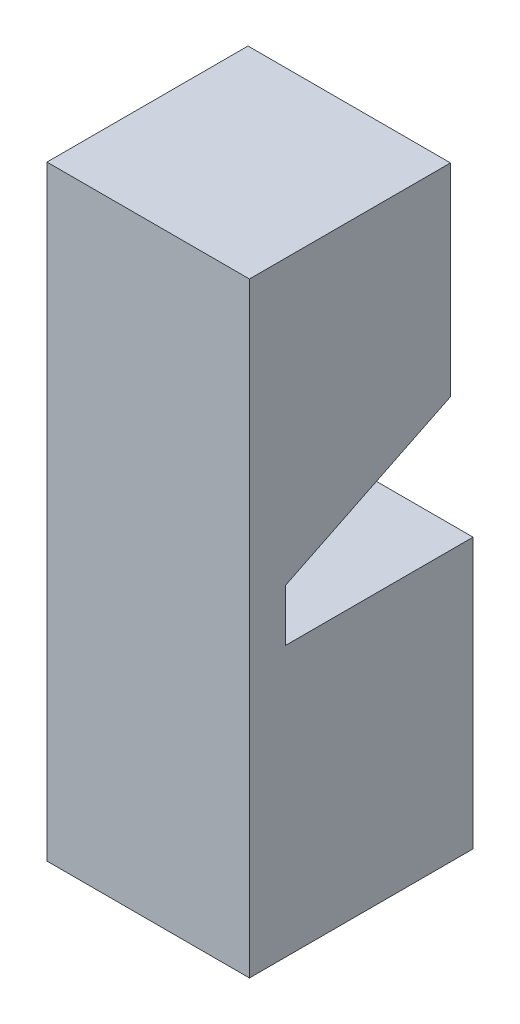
ISO-10303-21;
HEADER;
FILE_DESCRIPTION(('STEP AP214'),'2;1');
FILE_NAME('part.step','',(''),(''),'','','');
FILE_SCHEMA(('AUTOMOTIVE_DESIGN { 1 0 10303 214 1 1 1 1 }'));
ENDSEC;
DATA;
#1=APPLICATION_CONTEXT('core data for automotive mechanical design processes');
#2=APPLICATION_PROTOCOL_DEFINITION('international standard','automotive_design',2000,#1);
#3=PRODUCT_CONTEXT('',#1,'mechanical');
#4=PRODUCT('Part','Part','',(#3));
#5=PRODUCT_RELATED_PRODUCT_CATEGORY('part','',(#4));
#6=PRODUCT_DEFINITION_FORMATION('','',#4);
#7=PRODUCT_DEFINITION_CONTEXT('part definition',#1,'design');
#8=PRODUCT_DEFINITION('design','',#6,#7);
#9=PRODUCT_DEFINITION_SHAPE('','',#8);
#10=(LENGTH_UNIT() NAMED_UNIT(*) SI_UNIT(.MILLI.,.METRE.));
#11=(NAMED_UNIT(*) PLANE_ANGLE_UNIT() SI_UNIT($,.RADIAN.));
#12=(NAMED_UNIT(*) SI_UNIT($,.STERADIAN.) SOLID_ANGLE_UNIT());
#13=UNCERTAINTY_MEASURE_WITH_UNIT(LENGTH_MEASURE(1.E-05),#10,'distance_accuracy_value','');
#14=(GEOMETRIC_REPRESENTATION_CONTEXT(3) GLOBAL_UNCERTAINTY_ASSIGNED_CONTEXT((#13)) GLOBAL_UNIT_ASSIGNED_CONTEXT((#10,
#11,#12)) REPRESENTATION_CONTEXT('',''));
#15=CARTESIAN_POINT('',(0.,0.,0.));
#16=DIRECTION('',(0.,0.,1.));
#17=DIRECTION('',(1.,0.,0.));
#18=AXIS2_PLACEMENT_3D('',#15,#16,#17);
#19=CARTESIAN_POINT('',(609.6,0.,0.));
#20=DIRECTION('',(0.,0.,-1.));
#21=DIRECTION('',(-1.,0.,0.));
#22=AXIS2_PLACEMENT_3D('',#19,#20,#21);
#23=PLANE('',#22);
#24=DIRECTION('',(0.,-1.,0.));
#25=VECTOR('',#24,1.);
#26=CARTESIAN_POINT('',(0.,0.,0.));
#27=LINE('',#26,#25);
#28=CARTESIAN_POINT('',(0.,1822.45,0.));
#29=VERTEX_POINT('',#28);
#30=CARTESIAN_POINT('',(0.,0.,0.));
#31=VERTEX_POINT('',#30);
#32=EDGE_CURVE('E131',#29,#31,#27,.T.);
#33=ORIENTED_EDGE('',*,*,#32,.T.);
#34=DIRECTION('',(-1.,0.,0.));
#35=VECTOR('',#34,1.);
#36=CARTESIAN_POINT('',(609.6,0.,0.));
#37=LINE('',#36,#35);
#38=CARTESIAN_POINT('',(609.6,0.,0.));
#39=VERTEX_POINT('',#38);
#40=EDGE_CURVE('E11',#39,#31,#37,.T.);
#41=ORIENTED_EDGE('',*,*,#40,.F.);
#42=DIRECTION('',(0.,-1.,0.));
#43=VECTOR('',#42,1.);
#44=CARTESIAN_POINT('',(609.6,0.,0.));
#45=LINE('',#44,#43);
#46=CARTESIAN_POINT('',(609.6,1822.45,0.));
#47=VERTEX_POINT('',#46);
#48=EDGE_CURVE('E145',#47,#39,#45,.T.);
#49=ORIENTED_EDGE('',*,*,#48,.F.);
#50=DIRECTION('',(-1.,0.,0.));
#51=VECTOR('',#50,1.);
#52=CARTESIAN_POINT('',(609.6,1822.45,0.));
#53=LINE('',#52,#51);
#54=EDGE_CURVE('E127',#47,#29,#53,.T.);
#55=ORIENTED_EDGE('',*,*,#54,.T.);
#56=EDGE_LOOP('',(#33,#41,#49,#55));
#57=FACE_BOUND('',#56,.T.);
#58=ADVANCED_FACE('F35',(#57),#23,.F.);
#59=CARTESIAN_POINT('',(609.6,0.,0.));
#60=DIRECTION('',(0.,1.,0.));
#61=DIRECTION('',(0.,0.,1.));
#62=AXIS2_PLACEMENT_3D('',#59,#60,#61);
#63=PLANE('',#62);
#64=DIRECTION('',(0.,0.,-1.));
#65=VECTOR('',#64,1.);
#66=CARTESIAN_POINT('',(0.,0.,0.));
#67=LINE('',#66,#65);
#68=CARTESIAN_POINT('',(0.,0.,-673.1));
#69=VERTEX_POINT('',#68);
#70=EDGE_CURVE('E134',#31,#69,#67,.T.);
#71=ORIENTED_EDGE('',*,*,#70,.T.);
#72=DIRECTION('',(-1.,0.,0.));
#73=VECTOR('',#72,1.);
#74=CARTESIAN_POINT('',(609.6,0.,-673.1));
#75=LINE('',#74,#73);
#76=CARTESIAN_POINT('',(609.6,0.,-673.1));
#77=VERTEX_POINT('',#76);
#78=EDGE_CURVE('E43',#77,#69,#75,.T.);
#79=ORIENTED_EDGE('',*,*,#78,.F.);
#80=DIRECTION('',(0.,0.,-1.));
#81=VECTOR('',#80,1.);
#82=CARTESIAN_POINT('',(609.6,0.,0.));
#83=LINE('',#82,#81);
#84=EDGE_CURVE('E94',#39,#77,#83,.T.);
#85=ORIENTED_EDGE('',*,*,#84,.F.);
#86=ORIENTED_EDGE('',*,*,#40,.T.);
#87=EDGE_LOOP('',(#71,#79,#85,#86));
#88=FACE_BOUND('',#87,.T.);
#89=ADVANCED_FACE('F180',(#88),#63,.F.);
#90=CARTESIAN_POINT('',(609.6,0.,-673.1));
#91=DIRECTION('',(0.,0.,1.));
#92=DIRECTION('',(1.,0.,0.));
#93=AXIS2_PLACEMENT_3D('',#90,#91,#92);
#94=PLANE('',#93);
#95=DIRECTION('',(0.,1.,0.));
#96=VECTOR('',#95,1.);
#97=CARTESIAN_POINT('',(0.,0.,-673.1));
#98=LINE('',#97,#96);
#99=CARTESIAN_POINT('',(0.,812.8,-673.1));
#100=VERTEX_POINT('',#99);
#101=EDGE_CURVE('E136',#69,#100,#98,.T.);
#102=ORIENTED_EDGE('',*,*,#101,.T.);
#103=DIRECTION('',(-1.,0.,0.));
#104=VECTOR('',#103,1.);
#105=CARTESIAN_POINT('',(609.6,812.8,-673.1));
#106=LINE('',#105,#104);
#107=CARTESIAN_POINT('',(609.6,812.8,-673.1));
#108=VERTEX_POINT('',#107);
#109=EDGE_CURVE('E152',#108,#100,#106,.T.);
#110=ORIENTED_EDGE('',*,*,#109,.F.);
#111=DIRECTION('',(0.,1.,0.));
#112=VECTOR('',#111,1.);
#113=CARTESIAN_POINT('',(609.6,0.,-673.1));
#114=LINE('',#113,#112);
#115=EDGE_CURVE('E160',#77,#108,#114,.T.);
#116=ORIENTED_EDGE('',*,*,#115,.F.);
#117=ORIENTED_EDGE('',*,*,#78,.T.);
#118=EDGE_LOOP('',(#102,#110,#116,#117));
#119=FACE_BOUND('',#118,.T.);
#120=ADVANCED_FACE('F158',(#119),#94,.F.);
#121=CARTESIAN_POINT('',(609.6,812.8,-108.963945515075));
#122=DIRECTION('',(0.,-1.,0.));
#123=DIRECTION('',(0.,0.,-1.));
#124=AXIS2_PLACEMENT_3D('',#121,#122,#123);
#125=PLANE('',#124);
#126=DIRECTION('',(0.,0.,1.));
#127=VECTOR('',#126,1.);
#128=CARTESIAN_POINT('',(0.,812.8,-108.963945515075));
#129=LINE('',#128,#127);
#130=CARTESIAN_POINT('',(0.,812.8,-108.963945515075));
#131=VERTEX_POINT('',#130);
#132=EDGE_CURVE('E138',#100,#131,#129,.T.);
#133=ORIENTED_EDGE('',*,*,#132,.T.);
#134=DIRECTION('',(-1.,0.,0.));
#135=VECTOR('',#134,1.);
#136=CARTESIAN_POINT('',(609.6,812.8,-108.963945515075));
#137=LINE('',#136,#135);
#138=CARTESIAN_POINT('',(609.6,812.8,-108.963945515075));
#139=VERTEX_POINT('',#138);
#140=EDGE_CURVE('E149',#139,#131,#137,.T.);
#141=ORIENTED_EDGE('',*,*,#140,.F.);
#142=DIRECTION('',(0.,0.,1.));
#143=VECTOR('',#142,1.);
#144=CARTESIAN_POINT('',(609.6,812.8,-108.963945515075));
#145=LINE('',#144,#143);
#146=EDGE_CURVE('E172',#108,#139,#145,.T.);
#147=ORIENTED_EDGE('',*,*,#146,.F.);
#148=ORIENTED_EDGE('',*,*,#109,.T.);
#149=EDGE_LOOP('',(#133,#141,#147,#148));
#150=FACE_BOUND('',#149,.T.);
#151=ADVANCED_FACE('F168',(#150),#125,.F.);
#152=CARTESIAN_POINT('',(609.6,812.8,-108.963945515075));
#153=DIRECTION('',(0.,0.,1.));
#154=DIRECTION('',(0.,-1.,0.));
#155=AXIS2_PLACEMENT_3D('',#152,#153,#154);
#156=PLANE('',#155);
#157=DIRECTION('',(0.,1.,0.));
#158=VECTOR('',#157,1.);
#159=CARTESIAN_POINT('',(0.,812.8,-108.963945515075));
#160=LINE('',#159,#158);
#161=CARTESIAN_POINT('',(0.,969.652240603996,-108.963945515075));
#162=VERTEX_POINT('',#161);
#163=EDGE_CURVE('E140',#131,#162,#160,.T.);
#164=ORIENTED_EDGE('',*,*,#163,.T.);
#165=DIRECTION('',(-1.,0.,0.));
#166=VECTOR('',#165,1.);
#167=CARTESIAN_POINT('',(609.6,969.652240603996,-108.963945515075));
#168=LINE('',#167,#166);
#169=CARTESIAN_POINT('',(609.6,969.652240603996,-108.963945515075));
#170=VERTEX_POINT('',#169);
#171=EDGE_CURVE('E122',#170,#162,#168,.T.);
#172=ORIENTED_EDGE('',*,*,#171,.F.);
#173=DIRECTION('',(0.,1.,0.));
#174=VECTOR('',#173,1.);
#175=CARTESIAN_POINT('',(609.6,812.8,-108.963945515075));
#176=LINE('',#175,#174);
#177=EDGE_CURVE('E113',#139,#170,#176,.T.);
#178=ORIENTED_EDGE('',*,*,#177,.F.);
#179=ORIENTED_EDGE('',*,*,#140,.T.);
#180=EDGE_LOOP('',(#164,#172,#178,#179));
#181=FACE_BOUND('',#180,.T.);
#182=ADVANCED_FACE('F171',(#181),#156,.F.);
#183=CARTESIAN_POINT('',(609.6,969.652240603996,-108.963945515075));
#184=DIRECTION('',(0.,0.897956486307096,0.440084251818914));
#185=DIRECTION('',(0.,-0.440084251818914,0.897956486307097));
#186=AXIS2_PLACEMENT_3D('',#183,#184,#185);
#187=PLANE('',#186);
#188=DIRECTION('',(0.,0.440084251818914,-0.897956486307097));
#189=VECTOR('',#188,1.);
#190=CARTESIAN_POINT('',(0.,969.652240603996,-108.963945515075));
#191=LINE('',#190,#189);
#192=CARTESIAN_POINT('',(0.,1212.85,-605.189394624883));
#193=VERTEX_POINT('',#192);
#194=EDGE_CURVE('E121',#162,#193,#191,.T.);
#195=ORIENTED_EDGE('',*,*,#194,.T.);
#196=DIRECTION('',(-1.,0.,0.));
#197=VECTOR('',#196,1.);
#198=CARTESIAN_POINT('',(609.6,1212.85,-605.189394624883));
#199=LINE('',#198,#197);
#200=CARTESIAN_POINT('',(609.6,1212.85,-605.189394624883));
#201=VERTEX_POINT('',#200);
#202=EDGE_CURVE('E118',#201,#193,#199,.T.);
#203=ORIENTED_EDGE('',*,*,#202,.F.);
#204=DIRECTION('',(0.,0.440084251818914,-0.897956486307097));
#205=VECTOR('',#204,1.);
#206=CARTESIAN_POINT('',(609.6,969.652240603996,-108.963945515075));
#207=LINE('',#206,#205);
#208=EDGE_CURVE('E107',#170,#201,#207,.T.);
#209=ORIENTED_EDGE('',*,*,#208,.F.);
#210=ORIENTED_EDGE('',*,*,#171,.T.);
#211=EDGE_LOOP('',(#195,#203,#209,#210));
#212=FACE_BOUND('',#211,.T.);
#213=ADVANCED_FACE('F119',(#212),#187,.F.);
#214=CARTESIAN_POINT('',(609.6,1212.85,-605.189394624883));
#215=DIRECTION('',(0.,0.,1.));
#216=DIRECTION('',(1.,0.,0.));
#217=AXIS2_PLACEMENT_3D('',#214,#215,#216);
#218=PLANE('',#217);
#219=DIRECTION('',(0.,1.,0.));
#220=VECTOR('',#219,1.);
#221=CARTESIAN_POINT('',(0.,1212.85,-605.189394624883));
#222=LINE('',#221,#220);
#223=CARTESIAN_POINT('',(0.,1822.45,-605.189394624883));
#224=VERTEX_POINT('',#223);
#225=EDGE_CURVE('E80',#193,#224,#222,.T.);
#226=ORIENTED_EDGE('',*,*,#225,.T.);
#227=DIRECTION('',(-1.,0.,0.));
#228=VECTOR('',#227,1.);
#229=CARTESIAN_POINT('',(609.6,1822.45,-605.189394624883));
#230=LINE('',#229,#228);
#231=CARTESIAN_POINT('',(609.6,1822.45,-605.189394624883));
#232=VERTEX_POINT('',#231);
#233=EDGE_CURVE('E123',#232,#224,#230,.T.);
#234=ORIENTED_EDGE('',*,*,#233,.F.);
#235=DIRECTION('',(0.,1.,0.));
#236=VECTOR('',#235,1.);
#237=CARTESIAN_POINT('',(609.6,1212.85,-605.189394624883));
#238=LINE('',#237,#236);
#239=EDGE_CURVE('E111',#201,#232,#238,.T.);
#240=ORIENTED_EDGE('',*,*,#239,.F.);
#241=ORIENTED_EDGE('',*,*,#202,.T.);
#242=EDGE_LOOP('',(#226,#234,#240,#241));
#243=FACE_BOUND('',#242,.T.);
#244=ADVANCED_FACE('F125',(#243),#218,.F.);
#245=CARTESIAN_POINT('',(609.6,1822.45,0.));
#246=DIRECTION('',(0.,-1.,0.));
#247=DIRECTION('',(0.,0.,-1.));
#248=AXIS2_PLACEMENT_3D('',#245,#246,#247);
#249=PLANE('',#248);
#250=DIRECTION('',(0.,0.,1.));
#251=VECTOR('',#250,1.);
#252=CARTESIAN_POINT('',(0.,1822.45,0.));
#253=LINE('',#252,#251);
#254=EDGE_CURVE('E86',#224,#29,#253,.T.);
#255=ORIENTED_EDGE('',*,*,#254,.T.);
#256=ORIENTED_EDGE('',*,*,#54,.F.);
#257=DIRECTION('',(0.,0.,1.));
#258=VECTOR('',#257,1.);
#259=CARTESIAN_POINT('',(609.6,1822.45,0.));
#260=LINE('',#259,#258);
#261=EDGE_CURVE('E51',#232,#47,#260,.T.);
#262=ORIENTED_EDGE('',*,*,#261,.F.);
#263=ORIENTED_EDGE('',*,*,#233,.T.);
#264=EDGE_LOOP('',(#255,#256,#262,#263));
#265=FACE_BOUND('',#264,.T.);
#266=ADVANCED_FACE('F196',(#265),#249,.F.);
#267=CARTESIAN_POINT('',(609.6,1822.45,0.));
#268=DIRECTION('',(-1.,0.,0.));
#269=DIRECTION('',(0.,0.,1.));
#270=AXIS2_PLACEMENT_3D('',#267,#268,#269);
#271=PLANE('',#270);
#272=ORIENTED_EDGE('',*,*,#48,.T.);
#273=ORIENTED_EDGE('',*,*,#84,.T.);
#274=ORIENTED_EDGE('',*,*,#115,.T.);
#275=ORIENTED_EDGE('',*,*,#146,.T.);
#276=ORIENTED_EDGE('',*,*,#177,.T.);
#277=ORIENTED_EDGE('',*,*,#208,.T.);
#278=ORIENTED_EDGE('',*,*,#239,.T.);
#279=ORIENTED_EDGE('',*,*,#261,.T.);
#280=EDGE_LOOP('',(#272,#273,#274,#275,#276,#277,#278,#279));
#281=FACE_BOUND('',#280,.T.);
#282=ADVANCED_FACE('F109',(#281),#271,.F.);
#283=CARTESIAN_POINT('',(0.,1822.45,0.));
#284=DIRECTION('',(-1.,0.,0.));
#285=DIRECTION('',(0.,0.,1.));
#286=AXIS2_PLACEMENT_3D('',#283,#284,#285);
#287=PLANE('',#286);
#288=ORIENTED_EDGE('',*,*,#32,.F.);
#289=ORIENTED_EDGE('',*,*,#254,.F.);
#290=ORIENTED_EDGE('',*,*,#225,.F.);
#291=ORIENTED_EDGE('',*,*,#194,.F.);
#292=ORIENTED_EDGE('',*,*,#163,.F.);
#293=ORIENTED_EDGE('',*,*,#132,.F.);
#294=ORIENTED_EDGE('',*,*,#101,.F.);
#295=ORIENTED_EDGE('',*,*,#70,.F.);
#296=EDGE_LOOP('',(#288,#289,#290,#291,#292,#293,#294,#295));
#297=FACE_BOUND('',#296,.T.);
#298=ADVANCED_FACE('F164',(#297),#287,.T.);
#299=CLOSED_SHELL('',(#58,#89,#120,#151,#182,#213,#244,#266,#282,#298));
#300=MANIFOLD_SOLID_BREP('B2',#299);
#301=ADVANCED_BREP_SHAPE_REPRESENTATION('',(#18,#300),#14);
#302=SHAPE_DEFINITION_REPRESENTATION(#9,#301);
ENDSEC;
END-ISO-10303-21;
